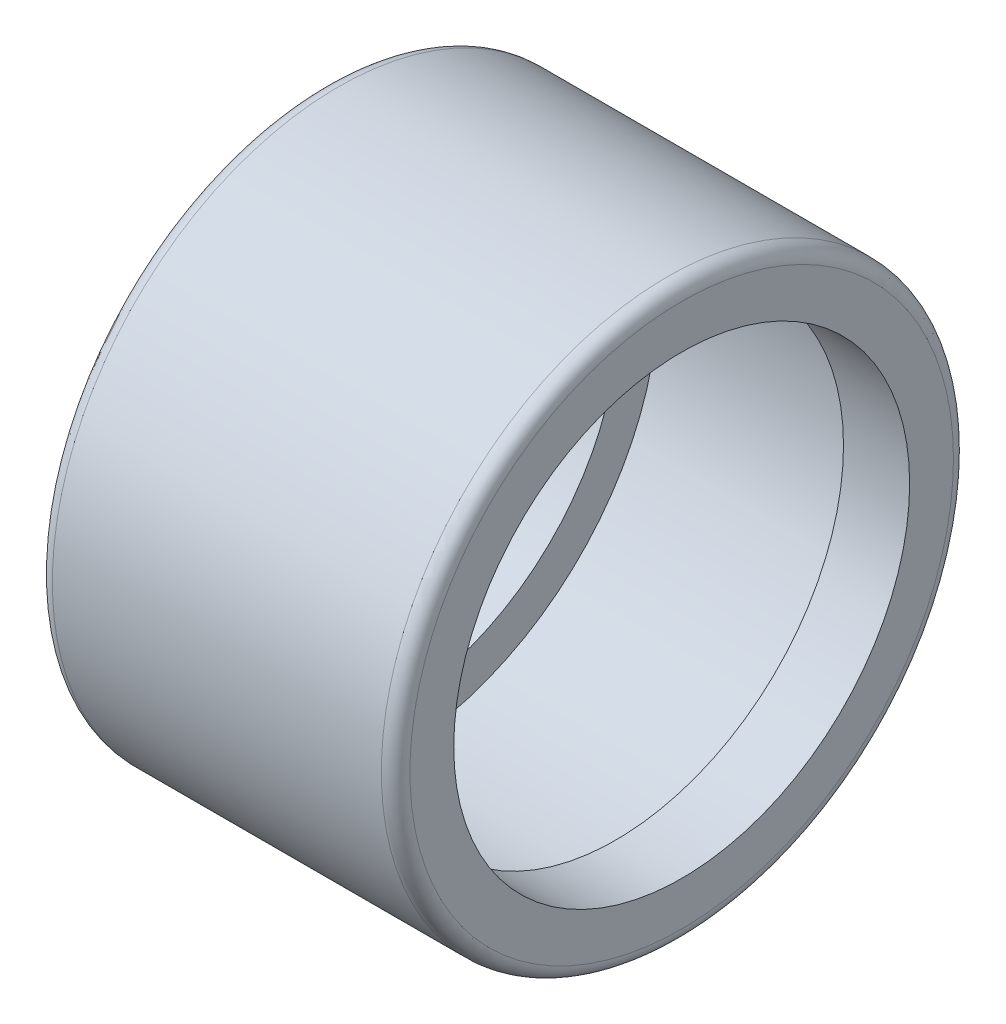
ISO-10303-21;
HEADER;
FILE_DESCRIPTION(('STEP AP214'),'2;1');
FILE_NAME('part.step','',(''),(''),'','','');
FILE_SCHEMA(('AUTOMOTIVE_DESIGN { 1 0 10303 214 1 1 1 1 }'));
ENDSEC;
DATA;
#1=APPLICATION_CONTEXT('core data for automotive mechanical design processes');
#2=APPLICATION_PROTOCOL_DEFINITION('international standard','automotive_design',2000,#1);
#3=PRODUCT_CONTEXT('',#1,'mechanical');
#4=PRODUCT('Part','Part','',(#3));
#5=PRODUCT_RELATED_PRODUCT_CATEGORY('part','',(#4));
#6=PRODUCT_DEFINITION_FORMATION('','',#4);
#7=PRODUCT_DEFINITION_CONTEXT('part definition',#1,'design');
#8=PRODUCT_DEFINITION('design','',#6,#7);
#9=PRODUCT_DEFINITION_SHAPE('','',#8);
#10=(LENGTH_UNIT() NAMED_UNIT(*) SI_UNIT(.MILLI.,.METRE.));
#11=(NAMED_UNIT(*) PLANE_ANGLE_UNIT() SI_UNIT($,.RADIAN.));
#12=(NAMED_UNIT(*) SI_UNIT($,.STERADIAN.) SOLID_ANGLE_UNIT());
#13=UNCERTAINTY_MEASURE_WITH_UNIT(LENGTH_MEASURE(1.E-05),#10,'distance_accuracy_value','');
#14=(GEOMETRIC_REPRESENTATION_CONTEXT(3) GLOBAL_UNCERTAINTY_ASSIGNED_CONTEXT((#13)) GLOBAL_UNIT_ASSIGNED_CONTEXT((#10,
#11,#12)) REPRESENTATION_CONTEXT('',''));
#15=CARTESIAN_POINT('',(0.,0.,0.));
#16=DIRECTION('',(0.,0.,1.));
#17=DIRECTION('',(1.,0.,0.));
#18=AXIS2_PLACEMENT_3D('',#15,#16,#17);
#19=CARTESIAN_POINT('',(9.6,0.,0.));
#20=DIRECTION('',(1.,0.,0.));
#21=DIRECTION('',(0.,0.,-1.));
#22=AXIS2_PLACEMENT_3D('',#19,#20,#21);
#23=TOROIDAL_SURFACE('',#22,7.6,0.400000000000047);
#24=CARTESIAN_POINT('',(9.6,0.,0.));
#25=DIRECTION('',(1.,0.,0.));
#26=DIRECTION('',(0.,0.,-1.));
#27=AXIS2_PLACEMENT_3D('',#24,#25,#26);
#28=CIRCLE('',#27,8.00000000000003);
#29=CARTESIAN_POINT('',(9.6,0.,-8.00000000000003));
#30=VERTEX_POINT('',#29);
#31=EDGE_CURVE('E10',#30,#30,#28,.T.);
#32=ORIENTED_EDGE('',*,*,#31,.T.);
#33=EDGE_LOOP('',(#32));
#34=FACE_BOUND('',#33,.T.);
#35=CARTESIAN_POINT('',(10.0000000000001,0.,0.));
#36=DIRECTION('',(1.,0.,0.));
#37=DIRECTION('',(0.,0.,-1.));
#38=AXIS2_PLACEMENT_3D('',#35,#36,#37);
#39=CIRCLE('',#38,7.6);
#40=CARTESIAN_POINT('',(10.0000000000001,0.,-7.6));
#41=VERTEX_POINT('',#40);
#42=EDGE_CURVE('E67',#41,#41,#39,.T.);
#43=ORIENTED_EDGE('',*,*,#42,.F.);
#44=EDGE_LOOP('',(#43));
#45=FACE_BOUND('',#44,.T.);
#46=ADVANCED_FACE('F33',(#34,#45),#23,.T.);
#47=CARTESIAN_POINT('',(-0.00135389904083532,0.,0.));
#48=DIRECTION('',(1.,0.,0.));
#49=DIRECTION('',(0.,0.,-1.));
#50=AXIS2_PLACEMENT_3D('',#47,#48,#49);
#51=CYLINDRICAL_SURFACE('',#50,8.00000000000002);
#52=CARTESIAN_POINT('',(0.4,0.,0.));
#53=DIRECTION('',(1.,0.,0.));
#54=DIRECTION('',(0.,0.,-1.));
#55=AXIS2_PLACEMENT_3D('',#52,#53,#54);
#56=CIRCLE('',#55,8.00000000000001);
#57=CARTESIAN_POINT('',(0.4,0.,-8.00000000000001));
#58=VERTEX_POINT('',#57);
#59=EDGE_CURVE('E39',#58,#58,#56,.T.);
#60=ORIENTED_EDGE('',*,*,#59,.T.);
#61=EDGE_LOOP('',(#60));
#62=FACE_BOUND('',#61,.T.);
#63=ORIENTED_EDGE('',*,*,#31,.F.);
#64=EDGE_LOOP('',(#63));
#65=FACE_BOUND('',#64,.T.);
#66=ADVANCED_FACE('F75',(#62,#65),#51,.T.);
#67=CARTESIAN_POINT('',(0.400000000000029,0.,0.));
#68=DIRECTION('',(1.,0.,0.));
#69=DIRECTION('',(0.,0.,-1.));
#70=AXIS2_PLACEMENT_3D('',#67,#68,#69);
#71=TOROIDAL_SURFACE('',#70,7.6,0.400000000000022);
#72=CARTESIAN_POINT('',(0.,0.,0.));
#73=DIRECTION('',(1.,0.,0.));
#74=DIRECTION('',(0.,0.,-1.));
#75=AXIS2_PLACEMENT_3D('',#72,#73,#74);
#76=CIRCLE('',#75,7.6);
#77=CARTESIAN_POINT('',(0.,0.,-7.6));
#78=VERTEX_POINT('',#77);
#79=EDGE_CURVE('E43',#78,#78,#76,.T.);
#80=ORIENTED_EDGE('',*,*,#79,.T.);
#81=EDGE_LOOP('',(#80));
#82=FACE_BOUND('',#81,.T.);
#83=ORIENTED_EDGE('',*,*,#59,.F.);
#84=EDGE_LOOP('',(#83));
#85=FACE_BOUND('',#84,.T.);
#86=ADVANCED_FACE('F79',(#82,#85),#71,.T.);
#87=CARTESIAN_POINT('',(0.,7.6,0.));
#88=DIRECTION('',(-1.,0.,0.));
#89=DIRECTION('',(0.,0.,1.));
#90=AXIS2_PLACEMENT_3D('',#87,#88,#89);
#91=PLANE('',#90);
#92=CARTESIAN_POINT('',(0.,0.,0.));
#93=DIRECTION('',(1.,0.,0.));
#94=DIRECTION('',(0.,0.,-1.));
#95=AXIS2_PLACEMENT_3D('',#92,#93,#94);
#96=CIRCLE('',#95,6.375);
#97=CARTESIAN_POINT('',(0.,0.,-6.375));
#98=VERTEX_POINT('',#97);
#99=EDGE_CURVE('E47',#98,#98,#96,.T.);
#100=ORIENTED_EDGE('',*,*,#99,.T.);
#101=EDGE_LOOP('',(#100));
#102=FACE_BOUND('',#101,.T.);
#103=ORIENTED_EDGE('',*,*,#79,.F.);
#104=EDGE_LOOP('',(#103));
#105=FACE_BOUND('',#104,.T.);
#106=ADVANCED_FACE('F83',(#102,#105),#91,.T.);
#107=CARTESIAN_POINT('',(-0.00135389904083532,0.,0.));
#108=DIRECTION('',(1.,0.,0.));
#109=DIRECTION('',(0.,0.,-1.));
#110=AXIS2_PLACEMENT_3D('',#107,#108,#109);
#111=CYLINDRICAL_SURFACE('',#110,6.375);
#112=CARTESIAN_POINT('',(1.85,0.,0.));
#113=DIRECTION('',(1.,0.,0.));
#114=DIRECTION('',(0.,0.,-1.));
#115=AXIS2_PLACEMENT_3D('',#112,#113,#114);
#116=CIRCLE('',#115,6.375);
#117=CARTESIAN_POINT('',(1.85,0.,-6.375));
#118=VERTEX_POINT('',#117);
#119=EDGE_CURVE('E52',#118,#118,#116,.T.);
#120=ORIENTED_EDGE('',*,*,#119,.T.);
#121=EDGE_LOOP('',(#120));
#122=FACE_BOUND('',#121,.T.);
#123=ORIENTED_EDGE('',*,*,#99,.F.);
#124=EDGE_LOOP('',(#123));
#125=FACE_BOUND('',#124,.T.);
#126=ADVANCED_FACE('F90',(#122,#125),#111,.F.);
#127=CARTESIAN_POINT('',(1.85,6.375,0.));
#128=DIRECTION('',(1.,0.,0.));
#129=DIRECTION('',(0.,0.,-1.));
#130=AXIS2_PLACEMENT_3D('',#127,#128,#129);
#131=PLANE('',#130);
#132=CARTESIAN_POINT('',(1.85,0.,0.));
#133=DIRECTION('',(1.,0.,0.));
#134=DIRECTION('',(0.,0.,-1.));
#135=AXIS2_PLACEMENT_3D('',#132,#133,#134);
#136=CIRCLE('',#135,7.5);
#137=CARTESIAN_POINT('',(1.85,0.,-7.5));
#138=VERTEX_POINT('',#137);
#139=EDGE_CURVE('E55',#138,#138,#136,.T.);
#140=ORIENTED_EDGE('',*,*,#139,.T.);
#141=EDGE_LOOP('',(#140));
#142=FACE_BOUND('',#141,.T.);
#143=ORIENTED_EDGE('',*,*,#119,.F.);
#144=EDGE_LOOP('',(#143));
#145=FACE_BOUND('',#144,.T.);
#146=ADVANCED_FACE('F94',(#142,#145),#131,.T.);
#147=CARTESIAN_POINT('',(-0.00135389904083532,0.,0.));
#148=DIRECTION('',(1.,0.,0.));
#149=DIRECTION('',(0.,0.,-1.));
#150=AXIS2_PLACEMENT_3D('',#147,#148,#149);
#151=CYLINDRICAL_SURFACE('',#150,7.5);
#152=CARTESIAN_POINT('',(8.15,0.,0.));
#153=DIRECTION('',(1.,0.,0.));
#154=DIRECTION('',(0.,0.,-1.));
#155=AXIS2_PLACEMENT_3D('',#152,#153,#154);
#156=CIRCLE('',#155,7.5);
#157=CARTESIAN_POINT('',(8.15,0.,-7.5));
#158=VERTEX_POINT('',#157);
#159=EDGE_CURVE('E58',#158,#158,#156,.T.);
#160=ORIENTED_EDGE('',*,*,#159,.T.);
#161=EDGE_LOOP('',(#160));
#162=FACE_BOUND('',#161,.T.);
#163=ORIENTED_EDGE('',*,*,#139,.F.);
#164=EDGE_LOOP('',(#163));
#165=FACE_BOUND('',#164,.T.);
#166=ADVANCED_FACE('F98',(#162,#165),#151,.F.);
#167=CARTESIAN_POINT('',(8.15,7.5,0.));
#168=DIRECTION('',(-1.,0.,0.));
#169=DIRECTION('',(0.,0.,1.));
#170=AXIS2_PLACEMENT_3D('',#167,#168,#169);
#171=PLANE('',#170);
#172=CARTESIAN_POINT('',(8.15,0.,0.));
#173=DIRECTION('',(1.,0.,0.));
#174=DIRECTION('',(0.,0.,-1.));
#175=AXIS2_PLACEMENT_3D('',#172,#173,#174);
#176=CIRCLE('',#175,6.375);
#177=CARTESIAN_POINT('',(8.15,0.,-6.375));
#178=VERTEX_POINT('',#177);
#179=EDGE_CURVE('E61',#178,#178,#176,.T.);
#180=ORIENTED_EDGE('',*,*,#179,.T.);
#181=EDGE_LOOP('',(#180));
#182=FACE_BOUND('',#181,.T.);
#183=ORIENTED_EDGE('',*,*,#159,.F.);
#184=EDGE_LOOP('',(#183));
#185=FACE_BOUND('',#184,.T.);
#186=ADVANCED_FACE('F102',(#182,#185),#171,.T.);
#187=CARTESIAN_POINT('',(-0.00135389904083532,0.,0.));
#188=DIRECTION('',(1.,0.,0.));
#189=DIRECTION('',(0.,0.,-1.));
#190=AXIS2_PLACEMENT_3D('',#187,#188,#189);
#191=CYLINDRICAL_SURFACE('',#190,6.375);
#192=CARTESIAN_POINT('',(10.,0.,0.));
#193=DIRECTION('',(1.,0.,0.));
#194=DIRECTION('',(0.,0.,-1.));
#195=AXIS2_PLACEMENT_3D('',#192,#193,#194);
#196=CIRCLE('',#195,6.375);
#197=CARTESIAN_POINT('',(10.,0.,-6.375));
#198=VERTEX_POINT('',#197);
#199=EDGE_CURVE('E64',#198,#198,#196,.T.);
#200=ORIENTED_EDGE('',*,*,#199,.T.);
#201=EDGE_LOOP('',(#200));
#202=FACE_BOUND('',#201,.T.);
#203=ORIENTED_EDGE('',*,*,#179,.F.);
#204=EDGE_LOOP('',(#203));
#205=FACE_BOUND('',#204,.T.);
#206=ADVANCED_FACE('F106',(#202,#205),#191,.F.);
#207=CARTESIAN_POINT('',(10.,6.375,0.));
#208=DIRECTION('',(1.,0.,0.));
#209=DIRECTION('',(0.,0.,-1.));
#210=AXIS2_PLACEMENT_3D('',#207,#208,#209);
#211=PLANE('',#210);
#212=ORIENTED_EDGE('',*,*,#42,.T.);
#213=EDGE_LOOP('',(#212));
#214=FACE_BOUND('',#213,.T.);
#215=ORIENTED_EDGE('',*,*,#199,.F.);
#216=EDGE_LOOP('',(#215));
#217=FACE_BOUND('',#216,.T.);
#218=ADVANCED_FACE('F71',(#214,#217),#211,.T.);
#219=CLOSED_SHELL('',(#46,#66,#86,#106,#126,#146,#166,#186,#206,#218));
#220=MANIFOLD_SOLID_BREP('B2',#219);
#221=ADVANCED_BREP_SHAPE_REPRESENTATION('',(#18,#220),#14);
#222=SHAPE_DEFINITION_REPRESENTATION(#9,#221);
ENDSEC;
END-ISO-10303-21;
